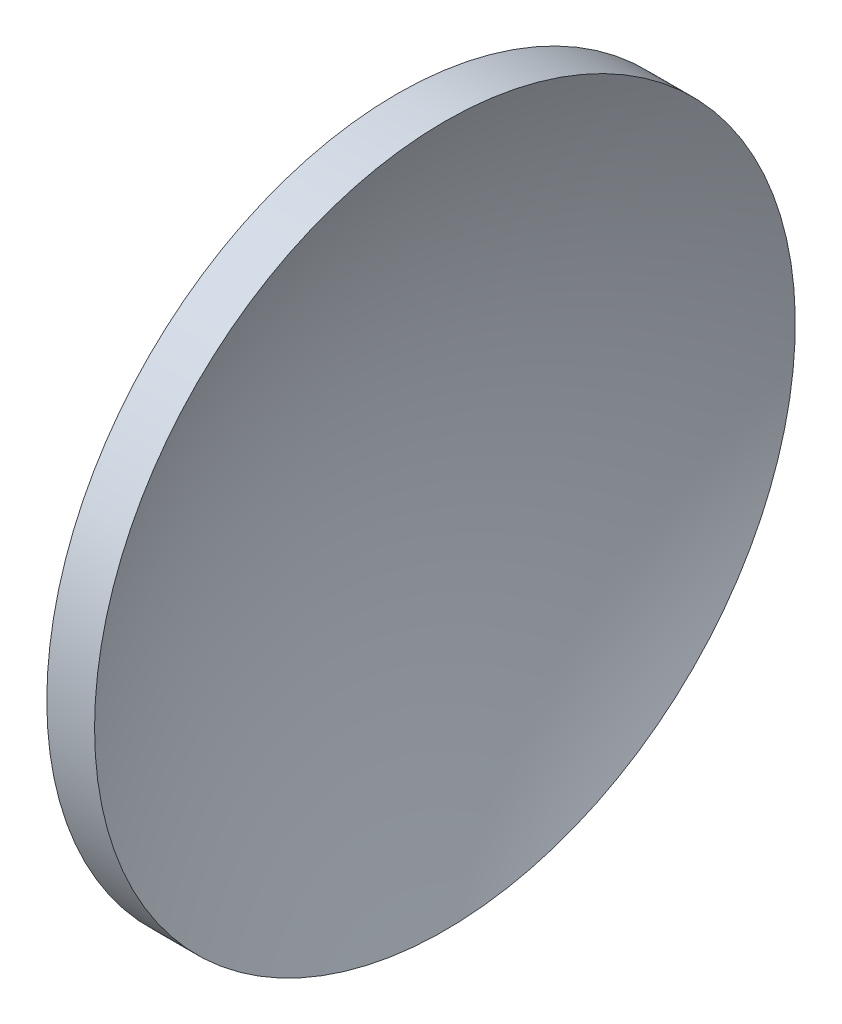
from build123d import *


with BuildPart() as part:
    # Sketch 2 → Revolve 2 (revolve)
    with BuildSketch(Plane.XY, mode=Mode.PRIVATE) as revolve_2_sk:
        with BuildLine():
            Line((2.67312518, 20.55), (5.474224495, 20.55))
            add(Edge.make_bspline(
                [(0.191256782, 0), (0.191256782, 0.083765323), (0.191925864, 0.255102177), (0.194936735, 0.638372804), (0.202963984, 0.981436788), (0.215001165, 1.413833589), (0.231042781, 1.796051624), (0.251083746, 2.206560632), (0.275114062, 2.601166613), (0.310130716, 3.103651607), (0.360087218, 3.700952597), (0.429901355, 4.399875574), (0.525361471, 5.195005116), (0.636372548, 5.989168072), (0.762731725, 6.780388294), (0.9043095, 7.569460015), (1.060808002, 8.355367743), (1.232156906, 9.138504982), (1.417871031, 9.917945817), (1.61810086, 10.694374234), (1.870989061, 11.607192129), (2.144866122, 12.515788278), (2.436932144, 13.41543391), (2.750318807, 14.313079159), (3.024577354, 15.061021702), (3.389869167, 16.003816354), (3.763141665, 16.915181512), (4.176490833, 17.858733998), (4.53533225, 18.642365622), (4.821765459, 19.240200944), (5.032595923, 19.678249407), (5.288284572, 20.185547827), (5.397571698, 20.401033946), (5.474224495, 20.55)],
                knots=[0.080243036, 0.080243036, 0.080243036, 0.080243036, 0.080243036, 0.095883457, 0.111523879, 0.1271643, 0.14280472, 0.158445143, 0.174085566, 0.189725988, 0.205366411, 0.236647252, 0.267928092, 0.299208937, 0.330489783, 0.361770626, 0.393051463, 0.424332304, 0.455613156, 0.486894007, 0.518174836, 0.549455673, 0.603577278, 0.634858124, 0.66613897, 0.697419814, 0.728700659, 0.791262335, 0.822543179, 0.853824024, 0.869464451, 0.885104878, 0.916385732, 0.916385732, 0.916385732, 0.916385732, 0.916385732], degree=4))
            Line((0.191256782, 0), (-2.5, 0))
            add(Edge.make_bspline(
                [(-2.5, 0), (-2.5, 0.083682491), (-2.499345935, 0.254865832), (-2.496402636, 0.637825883), (-2.488555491, 0.980595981), (-2.476788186, 1.412629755), (-2.461105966, 1.794529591), (-2.44151342, 2.204709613), (-2.418020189, 2.599004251), (-2.383784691, 3.101110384), (-2.334940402, 3.697983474), (-2.266674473, 4.396452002), (-2.173321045, 5.191134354), (-2.06474321, 5.984937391), (-1.941136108, 6.775889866), (-1.802613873, 7.564806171), (-1.64946871, 8.350663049), (-1.481747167, 9.133889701), (-1.299938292, 9.913522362), (-1.103848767, 10.690324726), (-0.857237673, 11.599736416), (-0.590106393, 12.5053342), (-0.305367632, 13.402007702), (0.00043374, 14.297432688), (0.268815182, 15.045956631), (0.556371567, 15.803838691), (0.844162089, 16.533945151), (1.240937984, 17.485390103), (1.578620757, 18.262253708), (1.948881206, 19.060990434), (2.244850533, 19.686410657), (2.490854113, 20.185123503), (2.597817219, 20.400535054), (2.67312518, 20.55)],
                knots=[0.080361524, 0.080361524, 0.080361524, 0.080361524, 0.080361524, 0.09601185, 0.111662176, 0.127312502, 0.142962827, 0.158613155, 0.174263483, 0.189913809, 0.205564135, 0.236864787, 0.268165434, 0.299466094, 0.330766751, 0.362067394, 0.393368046, 0.424668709, 0.455969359, 0.487269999, 0.518570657, 0.549871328, 0.603389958, 0.634690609, 0.665991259, 0.697291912, 0.728592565, 0.759893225, 0.791193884, 0.853795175, 0.869445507, 0.885095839, 0.916396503, 0.916396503, 0.916396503, 0.916396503, 0.916396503], degree=4))
        make_face()
    revolve(revolve_2_sk.sketch.rotate(Axis((-2.5, 0, 0), (1, 0, 0)), 90), axis=Axis((-2.5, 0, 0), (1, 0, 0)))


solid = part.part
